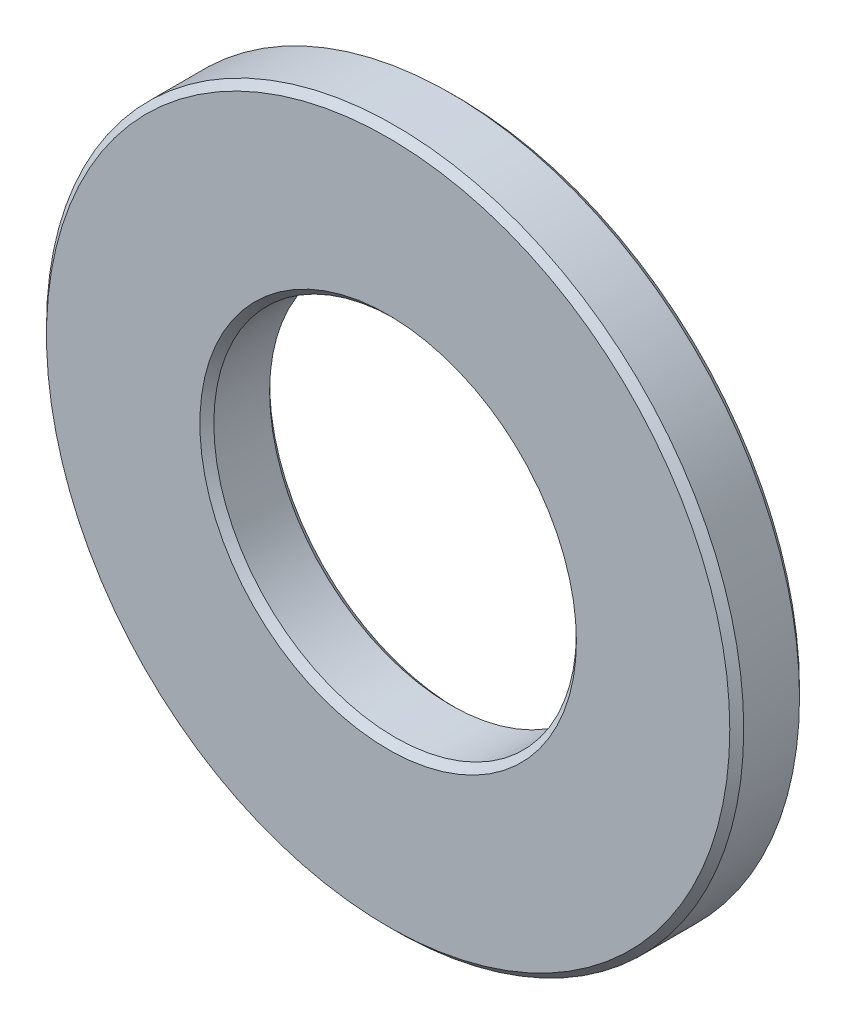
ISO-10303-21;
HEADER;
FILE_DESCRIPTION(('STEP AP214'),'2;1');
FILE_NAME('part.step','',(''),(''),'','','');
FILE_SCHEMA(('AUTOMOTIVE_DESIGN { 1 0 10303 214 1 1 1 1 }'));
ENDSEC;
DATA;
#1=APPLICATION_CONTEXT('core data for automotive mechanical design processes');
#2=APPLICATION_PROTOCOL_DEFINITION('international standard','automotive_design',2000,#1);
#3=PRODUCT_CONTEXT('',#1,'mechanical');
#4=PRODUCT('Part','Part','',(#3));
#5=PRODUCT_RELATED_PRODUCT_CATEGORY('part','',(#4));
#6=PRODUCT_DEFINITION_FORMATION('','',#4);
#7=PRODUCT_DEFINITION_CONTEXT('part definition',#1,'design');
#8=PRODUCT_DEFINITION('design','',#6,#7);
#9=PRODUCT_DEFINITION_SHAPE('','',#8);
#10=(LENGTH_UNIT() NAMED_UNIT(*) SI_UNIT(.MILLI.,.METRE.));
#11=(NAMED_UNIT(*) PLANE_ANGLE_UNIT() SI_UNIT($,.RADIAN.));
#12=(NAMED_UNIT(*) SI_UNIT($,.STERADIAN.) SOLID_ANGLE_UNIT());
#13=UNCERTAINTY_MEASURE_WITH_UNIT(LENGTH_MEASURE(1.E-05),#10,'distance_accuracy_value','');
#14=(GEOMETRIC_REPRESENTATION_CONTEXT(3) GLOBAL_UNCERTAINTY_ASSIGNED_CONTEXT((#13)) GLOBAL_UNIT_ASSIGNED_CONTEXT((#10,
#11,#12)) REPRESENTATION_CONTEXT('',''));
#15=CARTESIAN_POINT('',(0.,0.,0.));
#16=DIRECTION('',(0.,0.,1.));
#17=DIRECTION('',(1.,0.,0.));
#18=AXIS2_PLACEMENT_3D('',#15,#16,#17);
#19=CARTESIAN_POINT('',(0.,0.,0.5));
#20=DIRECTION('',(0.,0.,1.));
#21=DIRECTION('',(1.,0.,0.));
#22=AXIS2_PLACEMENT_3D('',#19,#20,#21);
#23=PLANE('',#22);
#24=CARTESIAN_POINT('',(0.,0.,0.5));
#25=DIRECTION('',(0.,0.,1.));
#26=DIRECTION('',(1.,0.,0.));
#27=AXIS2_PLACEMENT_3D('',#24,#25,#26);
#28=CIRCLE('',#27,2.7);
#29=CARTESIAN_POINT('',(2.7,0.,0.5));
#30=VERTEX_POINT('',#29);
#31=EDGE_CURVE('E10',#30,#30,#28,.F.);
#32=ORIENTED_EDGE('',*,*,#31,.T.);
#33=EDGE_LOOP('',(#32));
#34=FACE_BOUND('',#33,.T.);
#35=CARTESIAN_POINT('',(0.,0.,0.5));
#36=DIRECTION('',(0.,0.,1.));
#37=DIRECTION('',(1.,0.,0.));
#38=AXIS2_PLACEMENT_3D('',#35,#36,#37);
#39=CIRCLE('',#38,4.9);
#40=CARTESIAN_POINT('',(4.9,0.,0.5));
#41=VERTEX_POINT('',#40);
#42=EDGE_CURVE('E45',#41,#41,#39,.T.);
#43=ORIENTED_EDGE('',*,*,#42,.T.);
#44=EDGE_LOOP('',(#43));
#45=FACE_BOUND('',#44,.T.);
#46=ADVANCED_FACE('F37',(#34,#45),#23,.T.);
#47=CARTESIAN_POINT('',(0.,0.,-0.5));
#48=DIRECTION('',(0.,0.,1.));
#49=DIRECTION('',(1.,0.,0.));
#50=AXIS2_PLACEMENT_3D('',#47,#48,#49);
#51=PLANE('',#50);
#52=CARTESIAN_POINT('',(0.,0.,-0.5));
#53=DIRECTION('',(0.,0.,1.));
#54=DIRECTION('',(1.,0.,0.));
#55=AXIS2_PLACEMENT_3D('',#52,#53,#54);
#56=CIRCLE('',#55,4.9);
#57=CARTESIAN_POINT('',(4.9,0.,-0.5));
#58=VERTEX_POINT('',#57);
#59=EDGE_CURVE('E64',#58,#58,#56,.F.);
#60=ORIENTED_EDGE('',*,*,#59,.T.);
#61=EDGE_LOOP('',(#60));
#62=FACE_BOUND('',#61,.T.);
#63=CARTESIAN_POINT('',(0.,0.,-0.5));
#64=DIRECTION('',(0.,0.,1.));
#65=DIRECTION('',(1.,0.,0.));
#66=AXIS2_PLACEMENT_3D('',#63,#64,#65);
#67=CIRCLE('',#66,2.7);
#68=CARTESIAN_POINT('',(2.7,0.,-0.5));
#69=VERTEX_POINT('',#68);
#70=EDGE_CURVE('E67',#69,#69,#67,.T.);
#71=ORIENTED_EDGE('',*,*,#70,.T.);
#72=EDGE_LOOP('',(#71));
#73=FACE_BOUND('',#72,.T.);
#74=ADVANCED_FACE('F89',(#62,#73),#51,.F.);
#75=CARTESIAN_POINT('',(0.,0.,0.5));
#76=DIRECTION('',(0.,0.,-1.));
#77=DIRECTION('',(-1.,0.,0.));
#78=AXIS2_PLACEMENT_3D('',#75,#76,#77);
#79=CYLINDRICAL_SURFACE('',#78,5.);
#80=CARTESIAN_POINT('',(0.,0.,-0.400000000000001));
#81=DIRECTION('',(0.,0.,1.));
#82=DIRECTION('',(1.,0.,0.));
#83=AXIS2_PLACEMENT_3D('',#80,#81,#82);
#84=CIRCLE('',#83,5.);
#85=CARTESIAN_POINT('',(5.,0.,-0.400000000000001));
#86=VERTEX_POINT('',#85);
#87=EDGE_CURVE('E70',#86,#86,#84,.T.);
#88=ORIENTED_EDGE('',*,*,#87,.T.);
#89=EDGE_LOOP('',(#88));
#90=FACE_BOUND('',#89,.T.);
#91=CARTESIAN_POINT('',(0.,0.,0.399999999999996));
#92=DIRECTION('',(0.,0.,1.));
#93=DIRECTION('',(1.,0.,0.));
#94=AXIS2_PLACEMENT_3D('',#91,#92,#93);
#95=CIRCLE('',#94,5.);
#96=CARTESIAN_POINT('',(5.,0.,0.399999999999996));
#97=VERTEX_POINT('',#96);
#98=EDGE_CURVE('E73',#97,#97,#95,.F.);
#99=ORIENTED_EDGE('',*,*,#98,.T.);
#100=EDGE_LOOP('',(#99));
#101=FACE_BOUND('',#100,.T.);
#102=ADVANCED_FACE('F78',(#90,#101),#79,.T.);
#103=CARTESIAN_POINT('',(0.,0.,0.5));
#104=DIRECTION('',(0.,0.,-1.));
#105=DIRECTION('',(-1.,0.,0.));
#106=AXIS2_PLACEMENT_3D('',#103,#104,#105);
#107=CYLINDRICAL_SURFACE('',#106,2.6);
#108=CARTESIAN_POINT('',(0.,0.,-0.399999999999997));
#109=DIRECTION('',(0.,0.,1.));
#110=DIRECTION('',(1.,0.,0.));
#111=AXIS2_PLACEMENT_3D('',#108,#109,#110);
#112=CIRCLE('',#111,2.6);
#113=CARTESIAN_POINT('',(2.6,0.,-0.399999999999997));
#114=VERTEX_POINT('',#113);
#115=EDGE_CURVE('E52',#114,#114,#112,.F.);
#116=ORIENTED_EDGE('',*,*,#115,.T.);
#117=EDGE_LOOP('',(#116));
#118=FACE_BOUND('',#117,.T.);
#119=CARTESIAN_POINT('',(0.,0.,0.400000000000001));
#120=DIRECTION('',(0.,0.,1.));
#121=DIRECTION('',(1.,0.,0.));
#122=AXIS2_PLACEMENT_3D('',#119,#120,#121);
#123=CIRCLE('',#122,2.6);
#124=CARTESIAN_POINT('',(2.6,0.,0.400000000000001));
#125=VERTEX_POINT('',#124);
#126=EDGE_CURVE('E58',#125,#125,#123,.T.);
#127=ORIENTED_EDGE('',*,*,#126,.T.);
#128=EDGE_LOOP('',(#127));
#129=FACE_BOUND('',#128,.T.);
#130=ADVANCED_FACE('F97',(#118,#129),#107,.F.);
#131=CARTESIAN_POINT('',(0.,0.,-0.400000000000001));
#132=DIRECTION('',(0.,0.,1.));
#133=DIRECTION('',(1.,0.,0.));
#134=AXIS2_PLACEMENT_3D('',#131,#132,#133);
#135=CONICAL_SURFACE('',#134,5.,0.785398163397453);
#136=ORIENTED_EDGE('',*,*,#59,.F.);
#137=EDGE_LOOP('',(#136));
#138=FACE_BOUND('',#137,.T.);
#139=ORIENTED_EDGE('',*,*,#87,.F.);
#140=EDGE_LOOP('',(#139));
#141=FACE_BOUND('',#140,.T.);
#142=ADVANCED_FACE('F102',(#138,#141),#135,.T.);
#143=CARTESIAN_POINT('',(0.,0.,-0.5));
#144=DIRECTION('',(0.,0.,-1.));
#145=DIRECTION('',(-1.,0.,0.));
#146=AXIS2_PLACEMENT_3D('',#143,#144,#145);
#147=CONICAL_SURFACE('',#146,2.7,0.785398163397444);
#148=ORIENTED_EDGE('',*,*,#115,.F.);
#149=EDGE_LOOP('',(#148));
#150=FACE_BOUND('',#149,.T.);
#151=ORIENTED_EDGE('',*,*,#70,.F.);
#152=EDGE_LOOP('',(#151));
#153=FACE_BOUND('',#152,.T.);
#154=ADVANCED_FACE('F86',(#150,#153),#147,.F.);
#155=CARTESIAN_POINT('',(0.,0.,0.400000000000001));
#156=DIRECTION('',(0.,0.,1.));
#157=DIRECTION('',(1.,0.,0.));
#158=AXIS2_PLACEMENT_3D('',#155,#156,#157);
#159=CONICAL_SURFACE('',#158,2.6,0.78539816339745);
#160=ORIENTED_EDGE('',*,*,#31,.F.);
#161=EDGE_LOOP('',(#160));
#162=FACE_BOUND('',#161,.T.);
#163=ORIENTED_EDGE('',*,*,#126,.F.);
#164=EDGE_LOOP('',(#163));
#165=FACE_BOUND('',#164,.T.);
#166=ADVANCED_FACE('F82',(#162,#165),#159,.F.);
#167=CARTESIAN_POINT('',(0.,0.,0.5));
#168=DIRECTION('',(0.,0.,-1.));
#169=DIRECTION('',(-1.,0.,0.));
#170=AXIS2_PLACEMENT_3D('',#167,#168,#169);
#171=CONICAL_SURFACE('',#170,4.9,0.785398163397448);
#172=ORIENTED_EDGE('',*,*,#98,.F.);
#173=EDGE_LOOP('',(#172));
#174=FACE_BOUND('',#173,.T.);
#175=ORIENTED_EDGE('',*,*,#42,.F.);
#176=EDGE_LOOP('',(#175));
#177=FACE_BOUND('',#176,.T.);
#178=ADVANCED_FACE('F39',(#174,#177),#171,.T.);
#179=CLOSED_SHELL('',(#46,#74,#102,#130,#142,#154,#166,#178));
#180=MANIFOLD_SOLID_BREP('B2',#179);
#181=ADVANCED_BREP_SHAPE_REPRESENTATION('',(#18,#180),#14);
#182=SHAPE_DEFINITION_REPRESENTATION(#9,#181);
ENDSEC;
END-ISO-10303-21;
